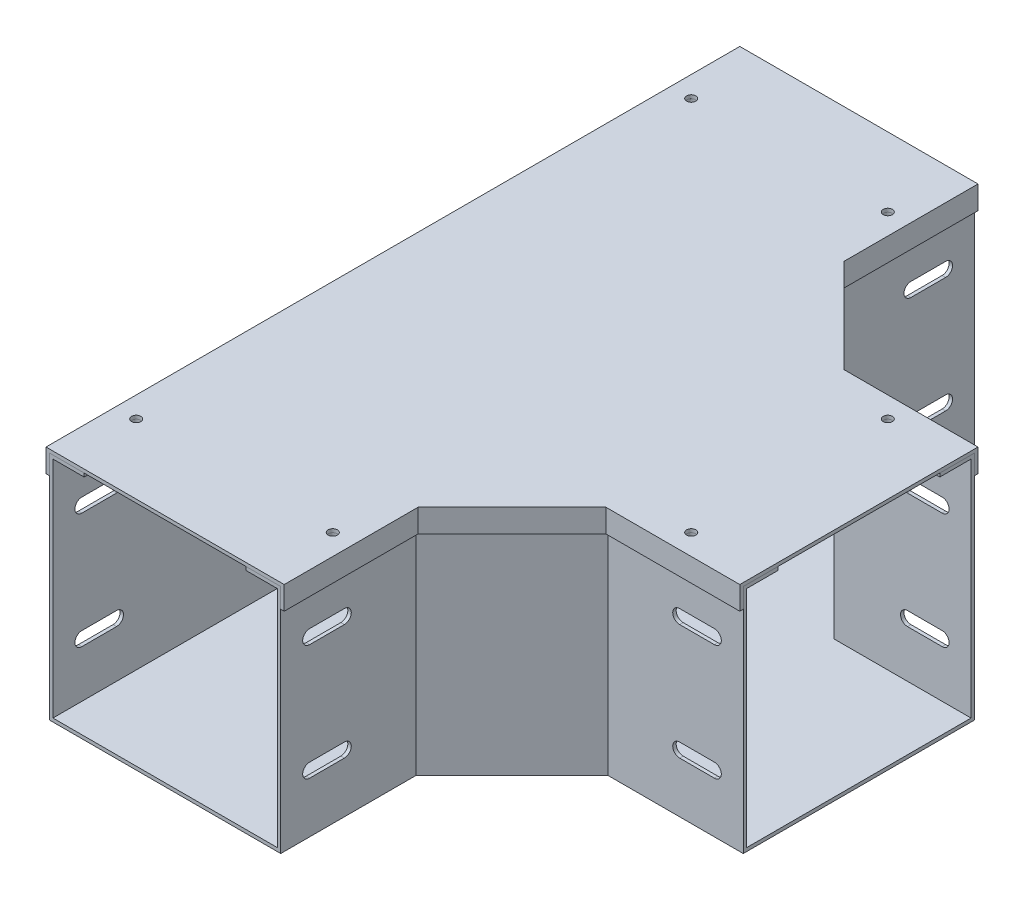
from build123d import *

# Parameters (mm, degrees)
BOSS_EXTRUDE1_DEPTH     = 1.5
SKETCH2_W               = 1.5
SKETCH2_H               = 300
EXTRUDE_THIN1_DEPTH     = 100
CUT_EXTRUDE1_DEPTH      = 218.944947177
CUT_EXTRUDE1_DEPTH_BACK = 218.944947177
CUT_EXTRUDE2_DEPTH      = 218.944947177
CUT_EXTRUDE2_DEPTH_BACK = 218.944947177
SKETCH5_W               = 15
SKETCH5_H               = 300
EXTRUDE_THIN4_DEPTH     = 1.5
CUT_EXTRUDE3_REACH      = 236.521
SKETCH6_R               = 2
BOSS_EXTRUDE2_DEPTH     = 1.5
SKETCH8_W               = 1.5
SKETCH8_H               = 300
EXTRUDE_THIN3_DEPTH     = 10
SKETCH9_R               = 2
CUT_EXTRUDE4_DEPTH      = 1.5


with BuildPart() as part:
    # Sketch1 → Boss-Extrude1 (new body)
    with BuildSketch(Plane(origin=(0, -50, 0), x_dir=(1, 0, 0), z_dir=(0, 1, 0))):
        Polygon((-50, 150), (50, 150), (50, 91.421356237), (91.421356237, 50), (150, 50), (150, -50), (91.421356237, -50), (50, -91.421356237), (50, -150), (-50, -150), align=None)
    extrude(amount=BOSS_EXTRUDE1_DEPTH)

    # Sketch2 → Extrude-Thin1 (add)
    with BuildSketch(Plane(origin=(0, -50, 0), x_dir=(-1, 0, 0), z_dir=(0, -1, 0))):
        Polygon((-50, -150), (-50, -91.421356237), (-91.421356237, -50), (-150, -50), (-150, -48.5), (-90.800035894, -48.5), (-48.5, -90.800035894), (-48.5, -150), align=None)
        with Locations((49.25, 0)):
            Rectangle(SKETCH2_W, SKETCH2_H)
        Polygon((-150, 50), (-91.421356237, 50), (-50, 91.421356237), (-50, 150), (-48.5, 150), (-48.5, 90.800035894), (-90.800035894, 48.5), (-150, 48.5), align=None)
    extrude(amount=-EXTRUDE_THIN1_DEPTH)

    # Sketch3 → Cut-Extrude1 (cut, two sides: drawn at the far end of the back side and taken through both)
    with BuildSketch(Plane.XY.offset(-CUT_EXTRUDE1_DEPTH_BACK)):
        with BuildLine():
            Line((122.5, 28), (137.5, 28))
            ThreePointArc((137.5, 28), (140.5, 25), (137.5, 22))
            Line((137.5, 22), (122.5, 22))
            ThreePointArc((122.5, 22), (119.5, 25), (122.5, 28))
        make_face()
        with BuildLine():
            Line((122.5, -22), (137.5, -22))
            ThreePointArc((137.5, -22), (140.5, -25), (137.5, -28))
            Line((137.5, -28), (122.5, -28))
            ThreePointArc((122.5, -28), (119.5, -25), (122.5, -22))
        make_face()
    extrude(amount=CUT_EXTRUDE1_DEPTH + CUT_EXTRUDE1_DEPTH_BACK, mode=Mode.SUBTRACT)

    # Sketch4 → Cut-Extrude2 (cut, two sides: drawn at the far end of the back side and taken through both)
    with BuildSketch(Plane(origin=(0, 0, 0), x_dir=(0, 0, -1), z_dir=(1, 0, 0)).offset(-CUT_EXTRUDE2_DEPTH_BACK)):
        with BuildLine():
            Line((-137.5, 28), (-122.5, 28))
            ThreePointArc((-122.5, 28), (-119.5, 25), (-122.5, 22))
            Line((-122.5, 22), (-137.5, 22))
            ThreePointArc((-137.5, 22), (-140.5, 25), (-137.5, 28))
        make_face()
        with BuildLine():
            Line((-137.5, -22), (-122.5, -22))
            ThreePointArc((-122.5, -22), (-119.5, -25), (-122.5, -28))
            Line((-122.5, -28), (-137.5, -28))
            ThreePointArc((-137.5, -28), (-140.5, -25), (-137.5, -22))
        make_face()
        with BuildLine():
            Line((122.5, 28), (137.5, 28))
            ThreePointArc((137.5, 28), (140.5, 25), (137.5, 22))
            Line((137.5, 22), (122.5, 22))
            ThreePointArc((122.5, 22), (119.5, 25), (122.5, 28))
        make_face()
        with BuildLine():
            Line((122.5, -22), (137.5, -22))
            ThreePointArc((137.5, -22), (140.5, -25), (137.5, -28))
            Line((137.5, -28), (122.5, -28))
            ThreePointArc((122.5, -28), (119.5, -25), (122.5, -22))
        make_face()
    extrude(amount=CUT_EXTRUDE2_DEPTH + CUT_EXTRUDE2_DEPTH_BACK, mode=Mode.SUBTRACT)

    # Sketch5 → Extrude-Thin4 (add)
    with BuildSketch(Plane(origin=(0, 50, 0), x_dir=(1, 0, 0), z_dir=(0, 1, 0))):
        with Locations((-42.5, 0)):
            Rectangle(SKETCH5_W, SKETCH5_H)
        Polygon((50, -150), (50, -91.421356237), (91.421356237, -50), (150, -50), (150, -35), (85.208152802, -35), (35, -85.208152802), (35, -150), align=None)
        Polygon((150, 50), (91.421356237, 50), (50, 91.421356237), (50, 150), (35, 150), (35, 85.208152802), (85.208152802, 35), (150, 35), align=None)
    extrude(amount=-EXTRUDE_THIN4_DEPTH)

    # Sketch6 → Cut-Extrude3 (cut, up to next)
    with BuildSketch(Plane(origin=(0, 50, 0), x_dir=(1, 0, 0), z_dir=(0, 1, 0)), mode=Mode.PRIVATE) as cut_extrude3_sk1:
        with Locations(Location((-42.5, 120, 0), (0, 0, 270))):
            Circle(SKETCH6_R)
    cut_extrude3_tool1 = extrude(cut_extrude3_sk1.sketch, amount=-CUT_EXTRUDE3_REACH, mode=Mode.PRIVATE) & part.part
    # Sketch6 → Cut-Extrude3 (cut, up to next)
    with BuildSketch(Plane(origin=(0, 50, 0), x_dir=(1, 0, 0), z_dir=(0, 1, 0)), mode=Mode.PRIVATE) as cut_extrude3_sk2:
        with Locations(Location((-42.5, -120, 0), (0, 0, 270))):
            Circle(SKETCH6_R)
    cut_extrude3_tool2 = extrude(cut_extrude3_sk2.sketch, amount=-CUT_EXTRUDE3_REACH, mode=Mode.PRIVATE) & part.part
    # Sketch6 → Cut-Extrude3 (cut, up to next)
    with BuildSketch(Plane(origin=(0, 50, 0), x_dir=(1, 0, 0), z_dir=(0, 1, 0)), mode=Mode.PRIVATE) as cut_extrude3_sk3:
        with Locations(Location((42.5, -120, 0), (0, 0, 270))):
            Circle(SKETCH6_R)
    cut_extrude3_tool3 = extrude(cut_extrude3_sk3.sketch, amount=-CUT_EXTRUDE3_REACH, mode=Mode.PRIVATE) & part.part
    # Sketch6 → Cut-Extrude3 (cut, up to next)
    with BuildSketch(Plane(origin=(0, 50, 0), x_dir=(1, 0, 0), z_dir=(0, 1, 0)), mode=Mode.PRIVATE) as cut_extrude3_sk4:
        with Locations(Location((120, -42.5, 0), (0, 0, 270))):
            Circle(SKETCH6_R)
    cut_extrude3_tool4 = extrude(cut_extrude3_sk4.sketch, amount=-CUT_EXTRUDE3_REACH, mode=Mode.PRIVATE) & part.part
    # Sketch6 → Cut-Extrude3 (cut, up to next)
    with BuildSketch(Plane(origin=(0, 50, 0), x_dir=(1, 0, 0), z_dir=(0, 1, 0)), mode=Mode.PRIVATE) as cut_extrude3_sk5:
        with Locations(Location((120, 42.5, 0), (0, 0, 270))):
            Circle(SKETCH6_R)
    cut_extrude3_tool5 = extrude(cut_extrude3_sk5.sketch, amount=-CUT_EXTRUDE3_REACH, mode=Mode.PRIVATE) & part.part
    # Sketch6 → Cut-Extrude3 (cut, up to next)
    with BuildSketch(Plane(origin=(0, 50, 0), x_dir=(1, 0, 0), z_dir=(0, 1, 0)), mode=Mode.PRIVATE) as cut_extrude3_sk6:
        with Locations(Location((42.5, 120, 0), (0, 0, 270))):
            Circle(SKETCH6_R)
    cut_extrude3_tool6 = extrude(cut_extrude3_sk6.sketch, amount=-CUT_EXTRUDE3_REACH, mode=Mode.PRIVATE) & part.part
    add(cut_extrude3_tool1.solids().sort_by_distance((-42.5, 50, -120))[0], mode=Mode.SUBTRACT)
    add(cut_extrude3_tool2.solids().sort_by_distance((-42.5, 50, 120))[0], mode=Mode.SUBTRACT)
    add(cut_extrude3_tool3.solids().sort_by_distance((42.5, 50, 120))[0], mode=Mode.SUBTRACT)
    add(cut_extrude3_tool4.solids().sort_by_distance((120, 50, 42.5))[0], mode=Mode.SUBTRACT)
    add(cut_extrude3_tool5.solids().sort_by_distance((120, 50, -42.5))[0], mode=Mode.SUBTRACT)
    add(cut_extrude3_tool6.solids().sort_by_distance((42.5, 50, -120))[0], mode=Mode.SUBTRACT)


with BuildPart() as body_2:
    # Sketch7 → Boss-Extrude2 (new body)
    with BuildSketch(Plane(origin=(0, 50, 0), x_dir=(1, 0, 0), z_dir=(0, 1, 0))):
        Polygon((91.421356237, 50), (50, 91.421356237), (50, 150), (-50, 150), (-50, -150), (50, -150), (50, -91.421356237), (91.421356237, -50), (150, -50), (150, 50), align=None)
    extrude(amount=BOSS_EXTRUDE2_DEPTH)

    # Sketch8 → Extrude-Thin3 (add)
    with BuildSketch(Plane(origin=(0, 51.5, 0), x_dir=(1, 0, 0), z_dir=(0, 1, 0))):
        Polygon((150, 50), (91.421356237, 50), (50, 91.421356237), (50, 150), (51.5, 150), (51.5, 92.042676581), (92.042676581, 51.5), (150, 51.5), align=None)
        with Locations((-50.75, 0)):
            Rectangle(SKETCH8_W, SKETCH8_H)
        Polygon((50, -150), (50, -91.421356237), (91.421356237, -50), (150, -50), (150, -51.5), (92.042676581, -51.5), (51.5, -92.042676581), (51.5, -150), align=None)
    extrude(amount=-EXTRUDE_THIN3_DEPTH)

    # Sketch9 → Cut-Extrude4 (cut)
    with BuildSketch(Plane(origin=(0, 51.5, 0), x_dir=(1, 0, 0), z_dir=(0, 1, 0))):
        with Locations(Location((42.5, 120, 0), (0, 0, 270))):
            Circle(SKETCH9_R)
        with Locations(Location((120, 42.5, 0), (0, 0, 270))):
            Circle(SKETCH9_R)
        with Locations(Location((120, -42.5, 0), (0, 0, 270))):
            Circle(SKETCH9_R)
        with Locations(Location((42.5, -120, 0), (0, 0, 270))):
            Circle(SKETCH9_R)
        with Locations(Location((-42.5, -120, 0), (0, 0, 270))):
            Circle(SKETCH9_R)
        with Locations(Location((-42.5, 120, 0), (0, 0, 270))):
            Circle(SKETCH9_R)
    extrude(amount=-CUT_EXTRUDE4_DEPTH, mode=Mode.SUBTRACT)


solid = Compound([part.part, body_2.part])
